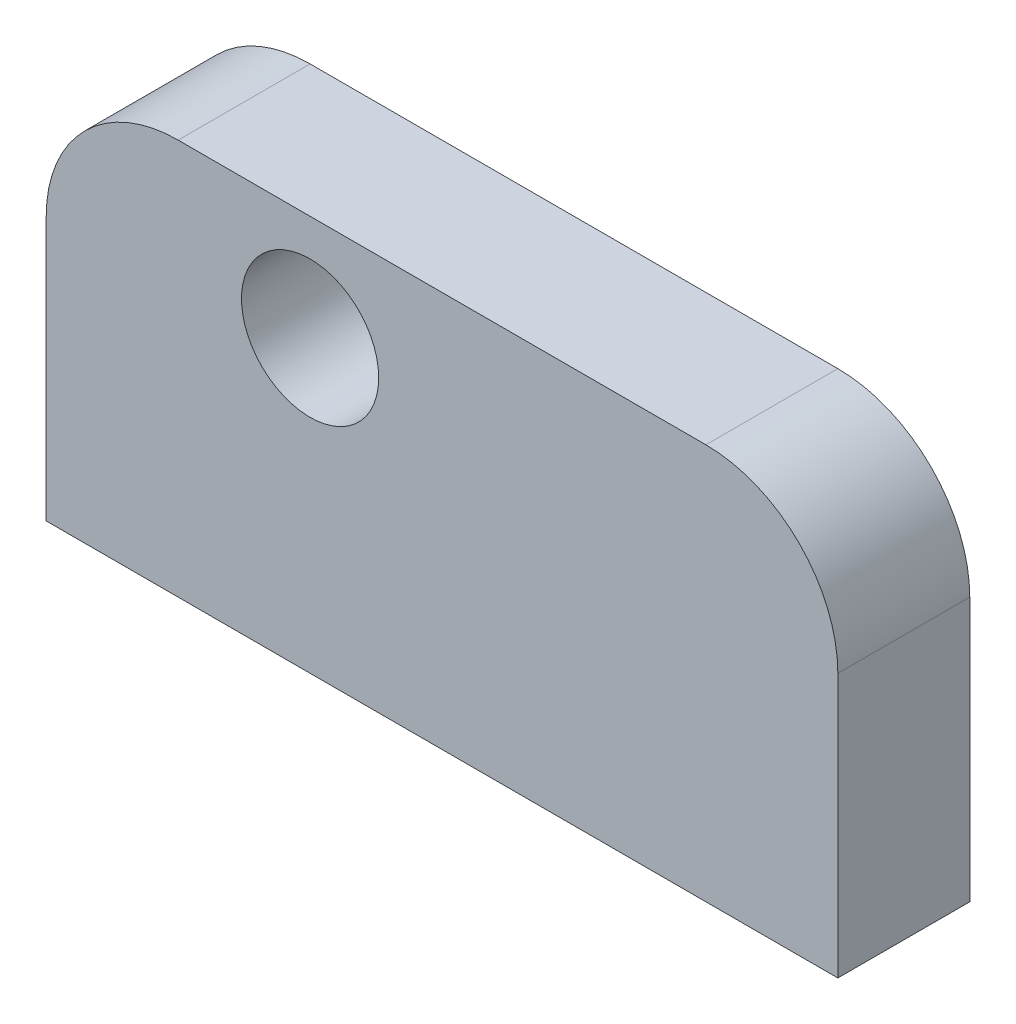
ISO-10303-21;
HEADER;
FILE_DESCRIPTION(('STEP AP214'),'2;1');
FILE_NAME('part.step','',(''),(''),'','','');
FILE_SCHEMA(('AUTOMOTIVE_DESIGN { 1 0 10303 214 1 1 1 1 }'));
ENDSEC;
DATA;
#1=APPLICATION_CONTEXT('core data for automotive mechanical design processes');
#2=APPLICATION_PROTOCOL_DEFINITION('international standard','automotive_design',2000,#1);
#3=PRODUCT_CONTEXT('',#1,'mechanical');
#4=PRODUCT('Part','Part','',(#3));
#5=PRODUCT_RELATED_PRODUCT_CATEGORY('part','',(#4));
#6=PRODUCT_DEFINITION_FORMATION('','',#4);
#7=PRODUCT_DEFINITION_CONTEXT('part definition',#1,'design');
#8=PRODUCT_DEFINITION('design','',#6,#7);
#9=PRODUCT_DEFINITION_SHAPE('','',#8);
#10=(LENGTH_UNIT() NAMED_UNIT(*) SI_UNIT(.MILLI.,.METRE.));
#11=(NAMED_UNIT(*) PLANE_ANGLE_UNIT() SI_UNIT($,.RADIAN.));
#12=(NAMED_UNIT(*) SI_UNIT($,.STERADIAN.) SOLID_ANGLE_UNIT());
#13=UNCERTAINTY_MEASURE_WITH_UNIT(LENGTH_MEASURE(1.E-05),#10,'distance_accuracy_value','');
#14=(GEOMETRIC_REPRESENTATION_CONTEXT(3) GLOBAL_UNCERTAINTY_ASSIGNED_CONTEXT((#13)) GLOBAL_UNIT_ASSIGNED_CONTEXT((#10,
#11,#12)) REPRESENTATION_CONTEXT('',''));
#15=CARTESIAN_POINT('',(0.,0.,0.));
#16=DIRECTION('',(0.,0.,1.));
#17=DIRECTION('',(1.,0.,0.));
#18=AXIS2_PLACEMENT_3D('',#15,#16,#17);
#19=CARTESIAN_POINT('',(0.,0.,6.35));
#20=DIRECTION('',(0.,0.,1.));
#21=DIRECTION('',(1.,0.,0.));
#22=AXIS2_PLACEMENT_3D('',#19,#20,#21);
#23=PLANE('',#22);
#24=DIRECTION('',(0.,1.,0.));
#25=VECTOR('',#24,1.);
#26=CARTESIAN_POINT('',(55.118,-57.023,6.35));
#27=LINE('',#26,#25);
#28=CARTESIAN_POINT('',(55.118,-57.023,6.35));
#29=VERTEX_POINT('',#28);
#30=CARTESIAN_POINT('',(55.118,-44.323,6.35));
#31=VERTEX_POINT('',#30);
#32=EDGE_CURVE('E86',#29,#31,#27,.T.);
#33=ORIENTED_EDGE('',*,*,#32,.T.);
#34=CARTESIAN_POINT('',(48.768,-44.323,6.35));
#35=DIRECTION('',(0.,0.,1.));
#36=DIRECTION('',(1.,0.,0.));
#37=AXIS2_PLACEMENT_3D('',#34,#35,#36);
#38=CIRCLE('',#37,6.35);
#39=CARTESIAN_POINT('',(48.768,-37.973,6.35));
#40=VERTEX_POINT('',#39);
#41=EDGE_CURVE('E41',#31,#40,#38,.T.);
#42=ORIENTED_EDGE('',*,*,#41,.T.);
#43=DIRECTION('',(-1.,0.,0.));
#44=VECTOR('',#43,1.);
#45=CARTESIAN_POINT('',(55.118,-37.973,6.35));
#46=LINE('',#45,#44);
#47=CARTESIAN_POINT('',(23.368,-37.973,6.35));
#48=VERTEX_POINT('',#47);
#49=EDGE_CURVE('E93',#40,#48,#46,.T.);
#50=ORIENTED_EDGE('',*,*,#49,.T.);
#51=CARTESIAN_POINT('',(23.368,-44.323,6.35));
#52=DIRECTION('',(0.,0.,1.));
#53=DIRECTION('',(1.,0.,0.));
#54=AXIS2_PLACEMENT_3D('',#51,#52,#53);
#55=CIRCLE('',#54,6.35);
#56=CARTESIAN_POINT('',(17.018,-44.323,6.35));
#57=VERTEX_POINT('',#56);
#58=EDGE_CURVE('E48',#48,#57,#55,.T.);
#59=ORIENTED_EDGE('',*,*,#58,.T.);
#60=DIRECTION('',(0.,-1.,0.));
#61=VECTOR('',#60,1.);
#62=CARTESIAN_POINT('',(17.018,-37.973,6.35));
#63=LINE('',#62,#61);
#64=CARTESIAN_POINT('',(17.018,-57.023,6.35));
#65=VERTEX_POINT('',#64);
#66=EDGE_CURVE('E98',#57,#65,#63,.T.);
#67=ORIENTED_EDGE('',*,*,#66,.T.);
#68=DIRECTION('',(1.,0.,0.));
#69=VECTOR('',#68,1.);
#70=CARTESIAN_POINT('',(17.018,-57.023,6.35));
#71=LINE('',#70,#69);
#72=EDGE_CURVE('E94',#65,#29,#71,.T.);
#73=ORIENTED_EDGE('',*,*,#72,.T.);
#74=EDGE_LOOP('',(#33,#42,#50,#59,#67,#73));
#75=FACE_BOUND('',#74,.T.);
#76=CARTESIAN_POINT('',(29.718,-43.053,6.35));
#77=DIRECTION('',(0.,0.,1.));
#78=DIRECTION('',(1.,0.,0.));
#79=AXIS2_PLACEMENT_3D('',#76,#77,#78);
#80=CIRCLE('',#79,3.302);
#81=CARTESIAN_POINT('',(33.02,-43.053,6.35));
#82=VERTEX_POINT('',#81);
#83=EDGE_CURVE('E139',#82,#82,#80,.T.);
#84=ORIENTED_EDGE('',*,*,#83,.F.);
#85=EDGE_LOOP('',(#84));
#86=FACE_BOUND('',#85,.T.);
#87=ADVANCED_FACE('F33',(#75,#86),#23,.T.);
#88=CARTESIAN_POINT('',(0.,0.,0.));
#89=DIRECTION('',(0.,0.,1.));
#90=DIRECTION('',(1.,0.,0.));
#91=AXIS2_PLACEMENT_3D('',#88,#89,#90);
#92=PLANE('',#91);
#93=DIRECTION('',(-1.,0.,0.));
#94=VECTOR('',#93,1.);
#95=CARTESIAN_POINT('',(55.118,-37.973,0.));
#96=LINE('',#95,#94);
#97=CARTESIAN_POINT('',(48.768,-37.973,0.));
#98=VERTEX_POINT('',#97);
#99=CARTESIAN_POINT('',(23.368,-37.973,0.));
#100=VERTEX_POINT('',#99);
#101=EDGE_CURVE('E136',#98,#100,#96,.T.);
#102=ORIENTED_EDGE('',*,*,#101,.F.);
#103=CARTESIAN_POINT('',(48.768,-44.323,0.));
#104=DIRECTION('',(0.,0.,1.));
#105=DIRECTION('',(1.,0.,0.));
#106=AXIS2_PLACEMENT_3D('',#103,#104,#105);
#107=CIRCLE('',#106,6.35);
#108=CARTESIAN_POINT('',(55.118,-44.323,0.));
#109=VERTEX_POINT('',#108);
#110=EDGE_CURVE('E119',#98,#109,#107,.F.);
#111=ORIENTED_EDGE('',*,*,#110,.T.);
#112=DIRECTION('',(0.,1.,0.));
#113=VECTOR('',#112,1.);
#114=CARTESIAN_POINT('',(55.118,-57.023,0.));
#115=LINE('',#114,#113);
#116=CARTESIAN_POINT('',(55.118,-57.023,0.));
#117=VERTEX_POINT('',#116);
#118=EDGE_CURVE('E135',#117,#109,#115,.T.);
#119=ORIENTED_EDGE('',*,*,#118,.F.);
#120=DIRECTION('',(1.,0.,0.));
#121=VECTOR('',#120,1.);
#122=CARTESIAN_POINT('',(17.018,-57.023,0.));
#123=LINE('',#122,#121);
#124=CARTESIAN_POINT('',(17.018,-57.023,0.));
#125=VERTEX_POINT('',#124);
#126=EDGE_CURVE('E106',#125,#117,#123,.T.);
#127=ORIENTED_EDGE('',*,*,#126,.F.);
#128=DIRECTION('',(0.,-1.,0.));
#129=VECTOR('',#128,1.);
#130=CARTESIAN_POINT('',(17.018,-37.973,0.));
#131=LINE('',#130,#129);
#132=CARTESIAN_POINT('',(17.018,-44.323,0.));
#133=VERTEX_POINT('',#132);
#134=EDGE_CURVE('E102',#133,#125,#131,.T.);
#135=ORIENTED_EDGE('',*,*,#134,.F.);
#136=CARTESIAN_POINT('',(23.368,-44.323,0.));
#137=DIRECTION('',(0.,0.,1.));
#138=DIRECTION('',(1.,0.,0.));
#139=AXIS2_PLACEMENT_3D('',#136,#137,#138);
#140=CIRCLE('',#139,6.35);
#141=EDGE_CURVE('E117',#133,#100,#140,.F.);
#142=ORIENTED_EDGE('',*,*,#141,.T.);
#143=EDGE_LOOP('',(#102,#111,#119,#127,#135,#142));
#144=FACE_BOUND('',#143,.T.);
#145=CARTESIAN_POINT('',(29.718,-43.053,0.));
#146=DIRECTION('',(0.,0.,1.));
#147=DIRECTION('',(1.,0.,0.));
#148=AXIS2_PLACEMENT_3D('',#145,#146,#147);
#149=CIRCLE('',#148,3.302);
#150=CARTESIAN_POINT('',(33.02,-43.053,0.));
#151=VERTEX_POINT('',#150);
#152=EDGE_CURVE('E224',#151,#151,#149,.T.);
#153=ORIENTED_EDGE('',*,*,#152,.T.);
#154=EDGE_LOOP('',(#153));
#155=FACE_BOUND('',#154,.T.);
#156=ADVANCED_FACE('F133',(#144,#155),#92,.F.);
#157=CARTESIAN_POINT('',(17.018,-57.023,6.35));
#158=DIRECTION('',(0.,1.,0.));
#159=DIRECTION('',(0.,0.,1.));
#160=AXIS2_PLACEMENT_3D('',#157,#158,#159);
#161=PLANE('',#160);
#162=ORIENTED_EDGE('',*,*,#126,.T.);
#163=DIRECTION('',(0.,0.,-1.));
#164=VECTOR('',#163,1.);
#165=CARTESIAN_POINT('',(55.118,-57.023,6.35));
#166=LINE('',#165,#164);
#167=EDGE_CURVE('E90',#29,#117,#166,.T.);
#168=ORIENTED_EDGE('',*,*,#167,.F.);
#169=ORIENTED_EDGE('',*,*,#72,.F.);
#170=DIRECTION('',(0.,0.,-1.));
#171=VECTOR('',#170,1.);
#172=CARTESIAN_POINT('',(17.018,-57.023,6.35));
#173=LINE('',#172,#171);
#174=EDGE_CURVE('E108',#65,#125,#173,.T.);
#175=ORIENTED_EDGE('',*,*,#174,.T.);
#176=EDGE_LOOP('',(#162,#168,#169,#175));
#177=FACE_BOUND('',#176,.T.);
#178=ADVANCED_FACE('F104',(#177),#161,.F.);
#179=CARTESIAN_POINT('',(55.118,-57.023,6.35));
#180=DIRECTION('',(-1.,0.,0.));
#181=DIRECTION('',(0.,0.,1.));
#182=AXIS2_PLACEMENT_3D('',#179,#180,#181);
#183=PLANE('',#182);
#184=ORIENTED_EDGE('',*,*,#118,.T.);
#185=DIRECTION('',(0.,0.,-1.));
#186=VECTOR('',#185,1.);
#187=CARTESIAN_POINT('',(55.118,-44.323,6.35));
#188=LINE('',#187,#186);
#189=EDGE_CURVE('E56',#109,#31,#188,.F.);
#190=ORIENTED_EDGE('',*,*,#189,.T.);
#191=ORIENTED_EDGE('',*,*,#32,.F.);
#192=ORIENTED_EDGE('',*,*,#167,.T.);
#193=EDGE_LOOP('',(#184,#190,#191,#192));
#194=FACE_BOUND('',#193,.T.);
#195=ADVANCED_FACE('F88',(#194),#183,.F.);
#196=CARTESIAN_POINT('',(55.118,-37.973,6.35));
#197=DIRECTION('',(0.,-1.,0.));
#198=DIRECTION('',(1.,0.,0.));
#199=AXIS2_PLACEMENT_3D('',#196,#197,#198);
#200=PLANE('',#199);
#201=ORIENTED_EDGE('',*,*,#49,.F.);
#202=DIRECTION('',(0.,0.,-1.));
#203=VECTOR('',#202,1.);
#204=CARTESIAN_POINT('',(48.768,-37.973,6.35));
#205=LINE('',#204,#203);
#206=EDGE_CURVE('E110',#40,#98,#205,.T.);
#207=ORIENTED_EDGE('',*,*,#206,.T.);
#208=ORIENTED_EDGE('',*,*,#101,.T.);
#209=DIRECTION('',(0.,0.,-1.));
#210=VECTOR('',#209,1.);
#211=CARTESIAN_POINT('',(23.368,-37.973,6.35));
#212=LINE('',#211,#210);
#213=EDGE_CURVE('E107',#100,#48,#212,.F.);
#214=ORIENTED_EDGE('',*,*,#213,.T.);
#215=EDGE_LOOP('',(#201,#207,#208,#214));
#216=FACE_BOUND('',#215,.T.);
#217=ADVANCED_FACE('F126',(#216),#200,.F.);
#218=CARTESIAN_POINT('',(17.018,-37.973,6.35));
#219=DIRECTION('',(1.,0.,0.));
#220=DIRECTION('',(0.,0.,-1.));
#221=AXIS2_PLACEMENT_3D('',#218,#219,#220);
#222=PLANE('',#221);
#223=ORIENTED_EDGE('',*,*,#66,.F.);
#224=DIRECTION('',(0.,0.,-1.));
#225=VECTOR('',#224,1.);
#226=CARTESIAN_POINT('',(17.018,-44.323,6.35));
#227=LINE('',#226,#225);
#228=EDGE_CURVE('E11',#57,#133,#227,.T.);
#229=ORIENTED_EDGE('',*,*,#228,.T.);
#230=ORIENTED_EDGE('',*,*,#134,.T.);
#231=ORIENTED_EDGE('',*,*,#174,.F.);
#232=EDGE_LOOP('',(#223,#229,#230,#231));
#233=FACE_BOUND('',#232,.T.);
#234=ADVANCED_FACE('F144',(#233),#222,.F.);
#235=CARTESIAN_POINT('',(29.718,-43.053,6.35));
#236=DIRECTION('',(0.,0.,-1.));
#237=DIRECTION('',(-1.,0.,0.));
#238=AXIS2_PLACEMENT_3D('',#235,#236,#237);
#239=CYLINDRICAL_SURFACE('',#238,3.302);
#240=ORIENTED_EDGE('',*,*,#83,.T.);
#241=EDGE_LOOP('',(#240));
#242=FACE_BOUND('',#241,.T.);
#243=ORIENTED_EDGE('',*,*,#152,.F.);
#244=EDGE_LOOP('',(#243));
#245=FACE_BOUND('',#244,.T.);
#246=ADVANCED_FACE('F151',(#242,#245),#239,.F.);
#247=CARTESIAN_POINT('',(48.768,-44.323,6.35));
#248=DIRECTION('',(0.,0.,-1.));
#249=DIRECTION('',(-1.,0.,0.));
#250=AXIS2_PLACEMENT_3D('',#247,#248,#249);
#251=CYLINDRICAL_SURFACE('',#250,6.35);
#252=ORIENTED_EDGE('',*,*,#41,.F.);
#253=ORIENTED_EDGE('',*,*,#189,.F.);
#254=ORIENTED_EDGE('',*,*,#110,.F.);
#255=ORIENTED_EDGE('',*,*,#206,.F.);
#256=EDGE_LOOP('',(#252,#253,#254,#255));
#257=FACE_BOUND('',#256,.T.);
#258=ADVANCED_FACE('F131',(#257),#251,.T.);
#259=CARTESIAN_POINT('',(23.368,-44.323,6.35));
#260=DIRECTION('',(0.,0.,-1.));
#261=DIRECTION('',(-1.,0.,0.));
#262=AXIS2_PLACEMENT_3D('',#259,#260,#261);
#263=CYLINDRICAL_SURFACE('',#262,6.35);
#264=ORIENTED_EDGE('',*,*,#58,.F.);
#265=ORIENTED_EDGE('',*,*,#213,.F.);
#266=ORIENTED_EDGE('',*,*,#141,.F.);
#267=ORIENTED_EDGE('',*,*,#228,.F.);
#268=EDGE_LOOP('',(#264,#265,#266,#267));
#269=FACE_BOUND('',#268,.T.);
#270=ADVANCED_FACE('F35',(#269),#263,.T.);
#271=CLOSED_SHELL('',(#87,#156,#178,#195,#217,#234,#246,#258,#270));
#272=MANIFOLD_SOLID_BREP('B2',#271);
#273=ADVANCED_BREP_SHAPE_REPRESENTATION('',(#18,#272),#14);
#274=SHAPE_DEFINITION_REPRESENTATION(#9,#273);
ENDSEC;
END-ISO-10303-21;
